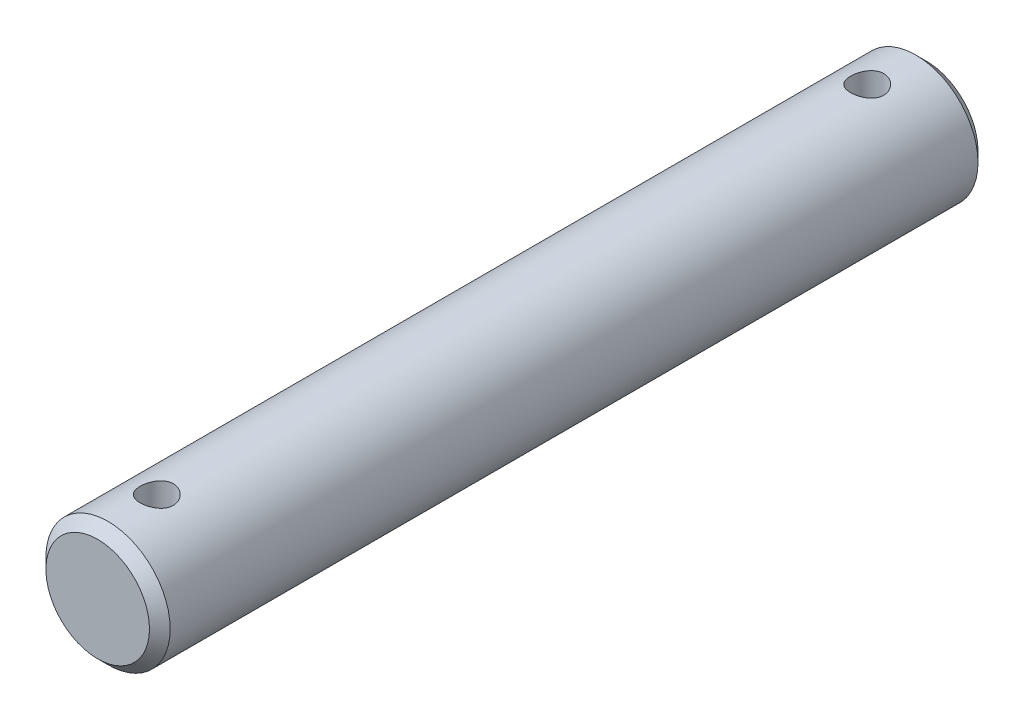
from build123d import *

# Parameters (mm, degrees)
ESQUISSE1_R           = 3
EXTRUSION1_DEPTH      = 20
CHANFREIN1_SIZE       = 0.5
EXTRUSION2_DEPTH      = 21.4450483
EXTRUSION2_DEPTH_BACK = 21.4450483
ESQUISSE2_R           = 0.8


with BuildPart() as part:
    # Esquisse1 → Extrusion1 (new, symmetric)
    with BuildSketch(Plane.XY):
        Circle(ESQUISSE1_R)
    extrude(amount=EXTRUSION1_DEPTH, both=True)

    # Chanfrein1
    chanfrein1_edges = [part.edges().sort_by_distance(p)[0] for p in [
        (-3, 0, -20),
        (-3, 0, 20),
    ]]
    chamfer(chanfrein1_edges, length=CHANFREIN1_SIZE)

    # Esquisse2 → Extrusion2 (cut, two sides: drawn at the far end of the back side and taken through both)
    with BuildSketch(Plane(origin=(0, 0, 0), x_dir=(1, 0, 0), z_dir=(0, 1, 0)).offset(-EXTRUSION2_DEPTH_BACK)):
        with Locations(Location((0, 17.15, 0), (0, 0, 270))):
            Circle(ESQUISSE2_R)
        with Locations(Location((0, -17.15, 0), (0, 0, 270))):
            Circle(ESQUISSE2_R)
    extrude(amount=EXTRUSION2_DEPTH + EXTRUSION2_DEPTH_BACK, mode=Mode.SUBTRACT)


solid = part.part
